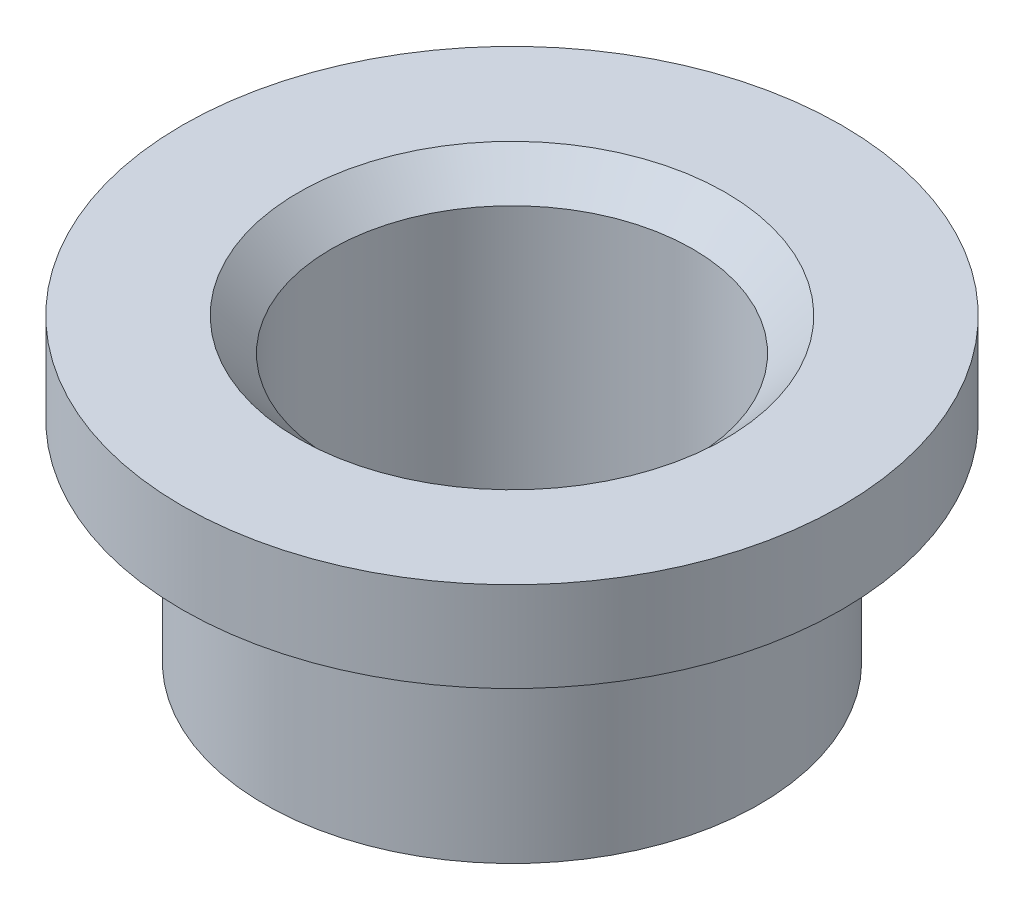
from build123d import *

# Parameters (mm, degrees)
SKETCH1_R           = 13.97
BOSS_EXTRUDE1_DEPTH = 3.81
SKETCH2_R           = 10.4775
BOSS_EXTRUDE2_DEPTH = 8.89


with BuildPart() as part:
    # Sketch1 → Boss-Extrude1 (new body)
    with BuildSketch(Plane(origin=(0, 0, 0), x_dir=(1, 0, 0), z_dir=(0, 1, 0))):
        with Locations(Location((0, 0, 0), (0, 0, 90))):
            Circle(SKETCH1_R)
    extrude(amount=BOSS_EXTRUDE1_DEPTH)

    # Sketch2 → Boss-Extrude2 (add)
    with BuildSketch(Plane.XZ):
        with Locations(Location((0, 0, 0), (0, 0, 270))):
            Circle(SKETCH2_R)
    extrude(amount=BOSS_EXTRUDE2_DEPTH)

    # Sketch3 → 3_8-18 NPSM Tapped Hole1 (revolve, cut)
    with BuildSketch(Plane(origin=(0, 3.81, 0), x_dir=(0, 0, 1), z_dir=(1, 0, 0))):
        Polygon((0, 0), (0, 12.7), (7.6581, 12.7), (7.6581, 1.3843), (9.0424, 0), align=None)
    revolve(axis=Axis((0, 10.16, 0), (0, -1, 0)), mode=Mode.SUBTRACT)


solid = part.part
